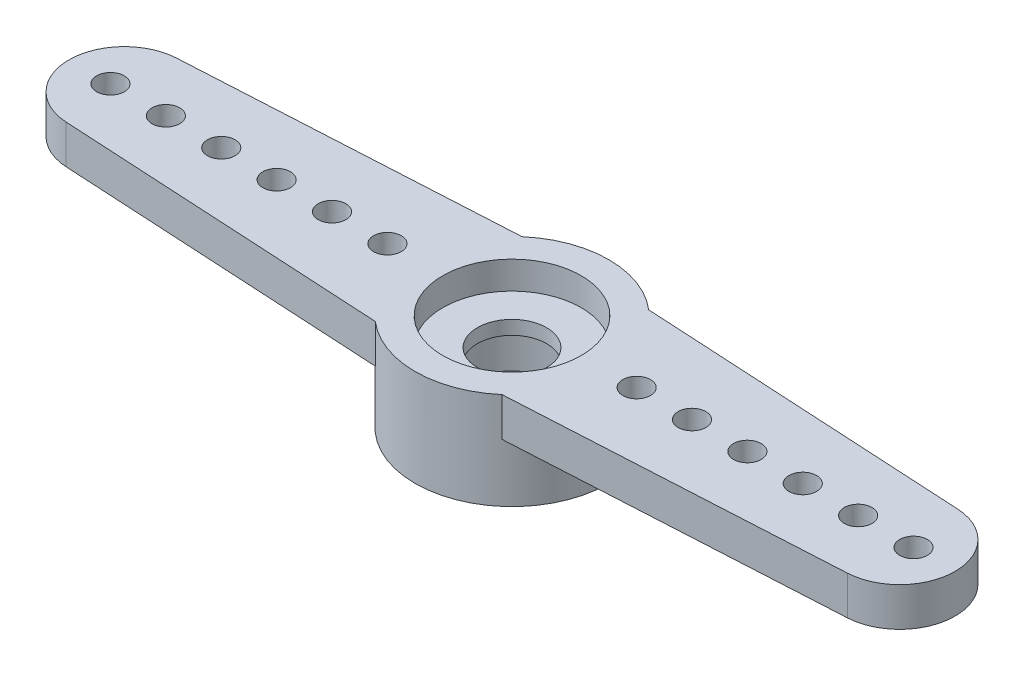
from build123d import *

# Parameters (mm, degrees)
SKICA1_R                  = 3.5
VYSUNOUT1_DEPTH           = 3.5
SKICA2_R                  = 2.5
ODEBRAT_VYSUNUT_M1_DEPTH  = 2
ODEBRAT_START             = -1
SKICA4_R                  = 2.5
ODEBRAT_VYSUNUT_M3_DEPTH  = 1
SKICA3_R                  = 1.25
ODEBRAT_VYSUNUT_M2_DEPTH  = 7.062177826
P_IDAT_VYSUNUT_M1_DEPTH   = 1.4
SKICA6_R                  = 0.5
ODEBRAT_VYSUNUT_M4_DEPTH  = 17.748134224
LINPOLE1_COUNT            = 6
LINPOLE1_PITCH            = 2
ZRCADLIT1_COPY_1_SKETCH_R = 0.5
ZRCADLIT1_COPY_1_DEPTH    = 17.748134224
ZRCADLIT1_COPY_2_SKETCH_R = 0.5
ZRCADLIT1_COPY_2_DEPTH    = 17.748134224
ZRCADLIT1_COPY_3_SKETCH_R = 0.5
ZRCADLIT1_COPY_3_DEPTH    = 17.748134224
ZRCADLIT1_COPY_4_SKETCH_R = 0.5
ZRCADLIT1_COPY_4_DEPTH    = 17.748134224
ZRCADLIT1_COPY_5_SKETCH_R = 0.5
ZRCADLIT1_COPY_5_DEPTH    = 17.748134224


with BuildPart() as part:
    # Skica1 → Vysunout1 (new body)
    with BuildSketch(Plane(origin=(0, 0, 0), x_dir=(1, 0, 0), z_dir=(0, 1, 0))):
        with Locations(Location((0, 0, 0), (0, 0, 270))):
            Circle(SKICA1_R)
    extrude(amount=-VYSUNOUT1_DEPTH)

    # Skica2 → Odebrat vysunut_m1 (cut)
    with BuildSketch(Plane.XZ.offset(3.5)):
        with Locations(Location((0, 0, 0), (0, 0, 270))):
            Circle(SKICA2_R)
    extrude(amount=-ODEBRAT_VYSUNUT_M1_DEPTH, mode=Mode.SUBTRACT)

    # Skica4 → Odebrat vysunut_m3 (cut)
    with BuildSketch(Plane(origin=(0, 0, 0), x_dir=(1, 0, 0), z_dir=(0, 1, 0)).offset(ODEBRAT_START)):
        with Locations(Location((0, 0, 0), (0, 0, 90))):
            Circle(SKICA4_R)
    extrude(amount=ODEBRAT_VYSUNUT_M3_DEPTH, mode=Mode.SUBTRACT)

    # Skica3 → Odebrat vysunut_m2 (cut, through all)
    with BuildSketch(Plane(origin=(0, 0, 0), x_dir=(-1, 0, 0), z_dir=(0, 1, 0))):
        with Locations(Location((0, 0, 0), (0, 0, 90))):
            Circle(SKICA3_R)
    extrude(amount=-ODEBRAT_VYSUNUT_M2_DEPTH, mode=Mode.SUBTRACT)

    # Skica5 → P_idat vysunut_m1 (add)
    with BuildSketch(Plane(origin=(0, 0, 0), x_dir=(1, 0, 0), z_dir=(0, 1, 0))):
        with BuildLine():
            Line((-14.110293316, -1.99695653), (-2.286372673, -2.65))
            ThreePointArc((-2.286372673, -2.65), (-3.5, 0), (-2.286372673, 2.65))
            Line((-2.286372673, 2.65), (-14.110293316, 1.99695653))
            ThreePointArc((-14.110293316, 1.99695653), (-16, 0), (-14.110293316, -1.99695653))
        make_face()
        with BuildLine():
            Line((14.110293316, 1.99695653), (2.286372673, 2.65))
            ThreePointArc((2.286372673, 2.65), (3.5, 0), (2.286372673, -2.65))
            Line((2.286372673, -2.65), (14.110293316, -1.99695653))
            ThreePointArc((14.110293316, -1.99695653), (16, 0), (14.110293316, 1.99695653))
        make_face()
    extrude(amount=-P_IDAT_VYSUNUT_M1_DEPTH)

    # Skica6 → Odebrat vysunut_m4 (cut, through all)
    with BuildSketch(Plane(origin=(0, 0, 0), x_dir=(1, 0, 0), z_dir=(0, 1, 0))):
        with Locations(Location((-14.5, 0, 0), (0, 0, 270))):
            Circle(SKICA6_R)
    odebrat_vysunut_m4 = extrude(amount=-ODEBRAT_VYSUNUT_M4_DEPTH, mode=Mode.SUBTRACT)

    # LinPole1: Odebrat vysunut_m4 ×6
    with Locations(*[(i * LINPOLE1_PITCH, 0, 0) for i in range(1, LINPOLE1_COUNT)]):
        add(odebrat_vysunut_m4, mode=Mode.SUBTRACT)

    # Zrcadlit1: Odebrat vysunut_m4 across plane
    add(odebrat_vysunut_m4.mirror(Plane(origin=(0, 0, 0), x_dir=(0, 0, 1), z_dir=(1, 0, 0))), mode=Mode.SUBTRACT)

    # Zrcadlit1 copy 1 sketch → Zrcadlit1 copy 1 (cut, through all)
    with BuildSketch(Plane(origin=(-2, 0, 0), x_dir=(-1, 0, 0), z_dir=(0, 1, 0))):
        with Locations((-14.5, 0)):
            Circle(ZRCADLIT1_COPY_1_SKETCH_R)
    extrude(amount=-ZRCADLIT1_COPY_1_DEPTH, mode=Mode.SUBTRACT)

    # Zrcadlit1 copy 2 sketch → Zrcadlit1 copy 2 (cut, through all)
    with BuildSketch(Plane(origin=(-4, 0, 0), x_dir=(-1, 0, 0), z_dir=(0, 1, 0))):
        with Locations((-14.5, 0)):
            Circle(ZRCADLIT1_COPY_2_SKETCH_R)
    extrude(amount=-ZRCADLIT1_COPY_2_DEPTH, mode=Mode.SUBTRACT)

    # Zrcadlit1 copy 3 sketch → Zrcadlit1 copy 3 (cut, through all)
    with BuildSketch(Plane(origin=(-6, 0, 0), x_dir=(-1, 0, 0), z_dir=(0, 1, 0))):
        with Locations((-14.5, 0)):
            Circle(ZRCADLIT1_COPY_3_SKETCH_R)
    extrude(amount=-ZRCADLIT1_COPY_3_DEPTH, mode=Mode.SUBTRACT)

    # Zrcadlit1 copy 4 sketch → Zrcadlit1 copy 4 (cut, through all)
    with BuildSketch(Plane(origin=(-8, 0, 0), x_dir=(-1, 0, 0), z_dir=(0, 1, 0))):
        with Locations((-14.5, 0)):
            Circle(ZRCADLIT1_COPY_4_SKETCH_R)
    extrude(amount=-ZRCADLIT1_COPY_4_DEPTH, mode=Mode.SUBTRACT)

    # Zrcadlit1 copy 5 sketch → Zrcadlit1 copy 5 (cut, through all)
    with BuildSketch(Plane(origin=(-10, 0, 0), x_dir=(-1, 0, 0), z_dir=(0, 1, 0))):
        with Locations((-14.5, 0)):
            Circle(ZRCADLIT1_COPY_5_SKETCH_R)
    extrude(amount=-ZRCADLIT1_COPY_5_DEPTH, mode=Mode.SUBTRACT)


solid = part.part
